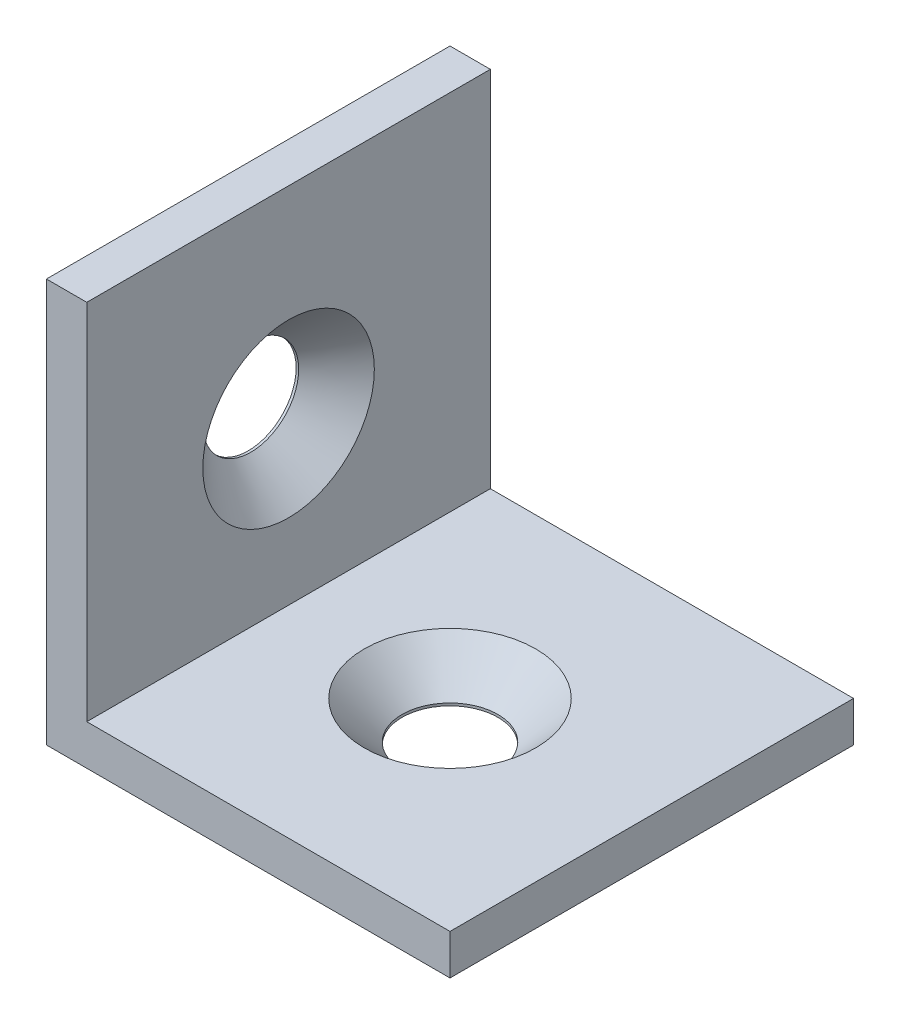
from build123d import *

# Parameters (mm, degrees)
EXTRUIR1_DEPTH = 40


with BuildPart() as part:
    # Croquis1 → Extruir1 (new body)
    with BuildSketch(Plane.XY):
        Polygon((0, 0), (40, 0), (40, 4), (4, 4), (4, 40), (0, 40), align=None)
    extrude(amount=EXTRUIR1_DEPTH)

    # Croquis5 → Taladro1 (revolve, cut)
    with BuildSketch(Plane(origin=(4, 20, 20), x_dir=(0, 0, -1), z_dir=(0, 1, 0))):
        Polygon((0, 0), (0, 4), (4.75, 4), (4.75, 3.75), (8.5, 0), align=None)
    revolve(axis=Axis((10.35, 20, 20), (-1, 0, 0)), mode=Mode.SUBTRACT)

    # Croquis5 at point 2 (on carried to point 2, square into its face) → Taladro1 at 2 (revolve, cut)
    with BuildSketch(Plane(origin=(20, 4, 20), x_dir=(0, 0, -1), z_dir=(-1, 0, 0))):
        Polygon((0, 0), (0, 4), (4.75, 4), (4.75, 3.75), (8.5, 0), align=None)
    revolve(axis=Axis((20, 10.35, 20), (0, -1, 0)), mode=Mode.SUBTRACT)


solid = part.part
